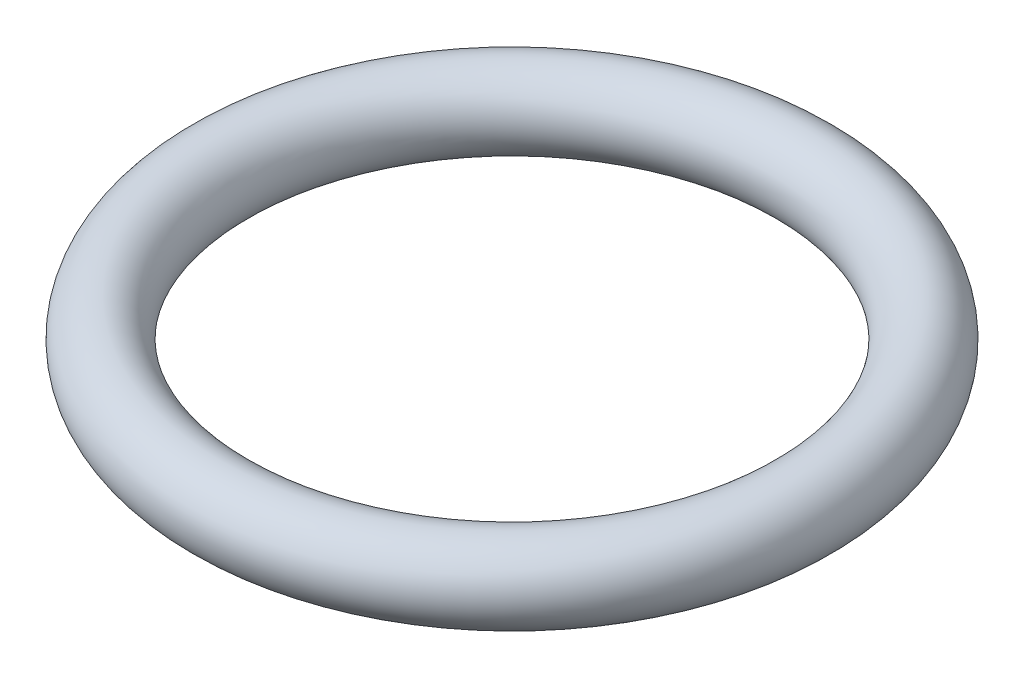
from build123d import *

# Parameters (mm, degrees)
SKETCH1_R = 1.3081


with BuildPart() as part:
    # Sketch1 → Revolve1 (revolve)
    with BuildSketch(Plane(origin=(0, 0, 0), x_dir=(0, 0, -1), z_dir=(1, 0, 0))):
        with Locations((9.8679, 0)):
            Circle(SKETCH1_R)
    revolve(axis=Axis((0, 0, 0), (0, 1, 0)))


solid = part.part
